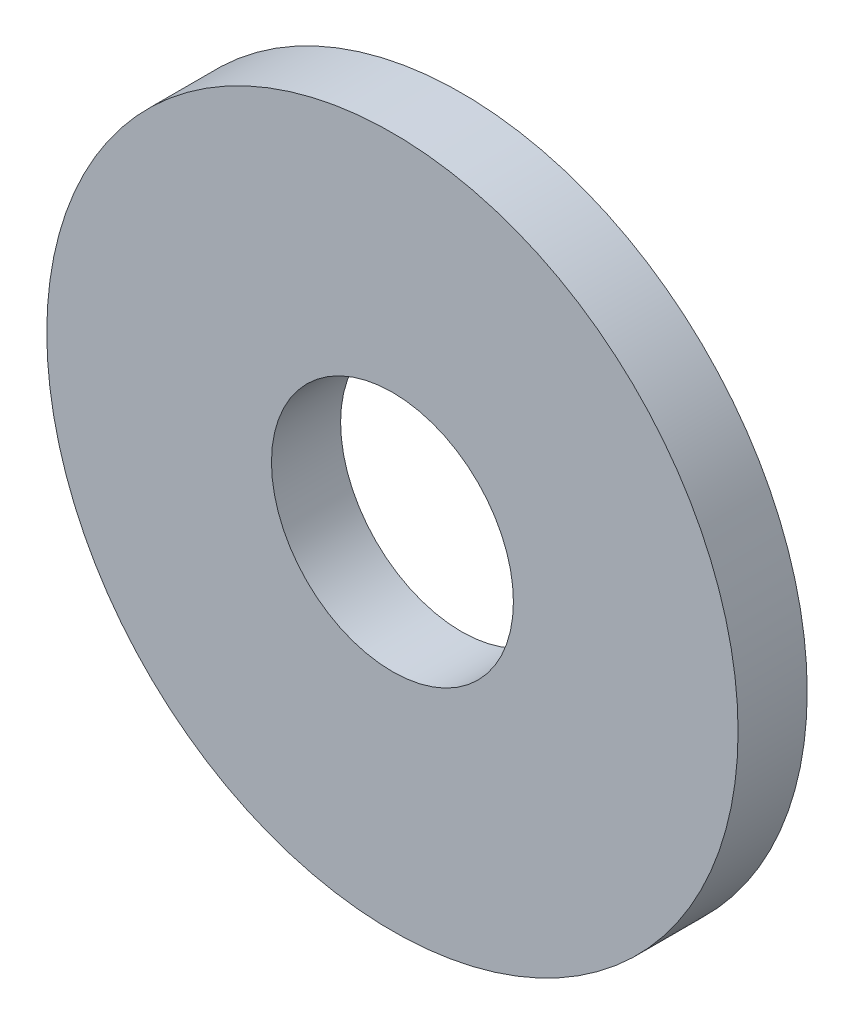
from build123d import *

# Parameters (mm, degrees)
ESQUISSE1_R             = 15
EXTRUSION1_DEPTH        = 3
ESQUISSE2_R             = 5.25
ENL_V_MAT_EXTRU_1_DEPTH = 22.424285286


with BuildPart() as part:
    # Esquisse1 → Extrusion1 (new body)
    with BuildSketch(Plane.XY):
        Circle(ESQUISSE1_R)
    extrude(amount=EXTRUSION1_DEPTH)

    # Esquisse2 → Enl_v. mat.-Extru.1 (cut, through all)
    with BuildSketch(Plane.XY.offset(3)):
        Circle(ESQUISSE2_R)
    extrude(amount=-ENL_V_MAT_EXTRU_1_DEPTH, mode=Mode.SUBTRACT)


solid = part.part
